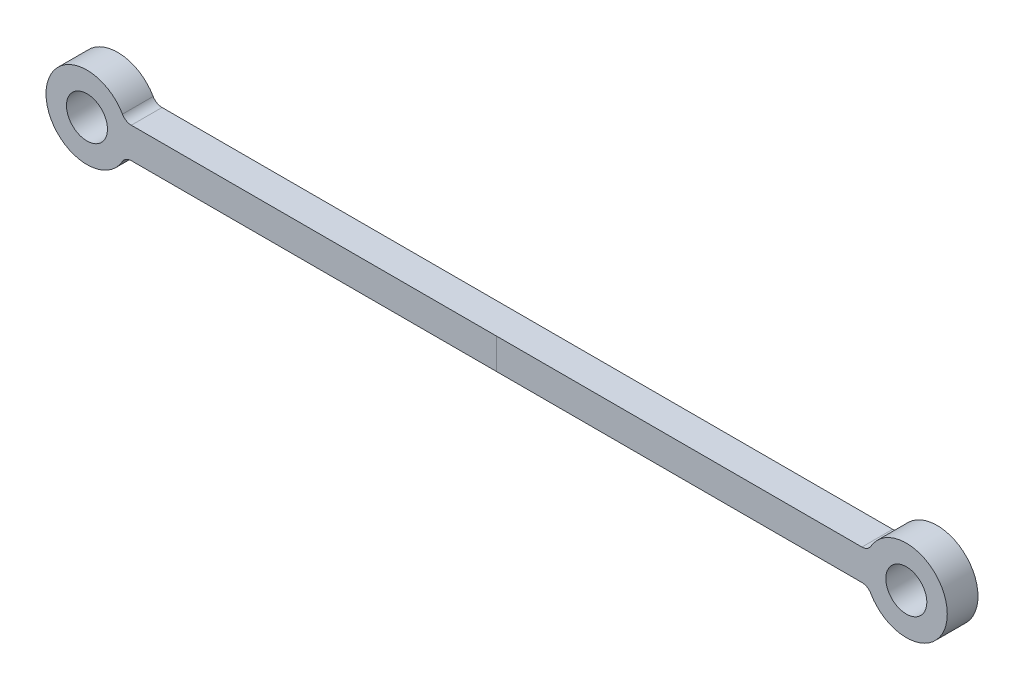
from build123d import *

# Parameters (mm, degrees)
SKETCH1_W            = 800
SKETCH1_H            = 30
EXTRUDE1_DEPTH       = 30
SKETCH2_R            = 40
EXTRUDE2_DEPTH       = 30
SKETCH3_R            = 20
CUT_EXTRUDE1_DEPTH   = 443.83179651
FILLET2_R            = 10
FILLET2_OF_MIRROR1_R = 10


with BuildPart() as part:
    # Sketch1 → Extrude1 (new body)
    with BuildSketch(Plane.XY):
        Rectangle(SKETCH1_W, SKETCH1_H)
    extrude(amount=EXTRUDE1_DEPTH)

    # Sketch2 → Extrude2 (add)
    with BuildSketch(Plane.XY.offset(30)):
        with Locations((-400, 0)):
            Circle(SKETCH2_R)
    extrude2 = extrude(amount=-EXTRUDE2_DEPTH)

    # Sketch3 → Cut-Extrude1 (cut, through all)
    with BuildSketch(Plane.XY.offset(30)):
        with Locations((-400, 0)):
            Circle(SKETCH3_R)
    cut_extrude1 = extrude(amount=-CUT_EXTRUDE1_DEPTH, mode=Mode.SUBTRACT)

    # Fillet2
    fillet2_edges = [part.edges().sort_by_distance(p)[0] for p in [
        (-362.919007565, -15, 15),
        (-362.919007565, 15, 15),
    ]]
    fillet(fillet2_edges, radius=FILLET2_R)

    # Mirror1: Extrude2, Cut-Extrude1 across plane
    add(extrude2.mirror(Plane(origin=(0, 0, 0), x_dir=(0, 0, 1), z_dir=(1, 0, 0))))
    add(cut_extrude1.mirror(Plane(origin=(0, 0, 0), x_dir=(0, 0, 1), z_dir=(1, 0, 0))), mode=Mode.SUBTRACT)

    # Fillet2 of Mirror1
    fillet2_of_mirror1_edges = [part.edges().sort_by_distance(p)[0] for p in [
        (362.919007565, -15, 15),
        (362.919007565, 15, 15),
    ]]
    fillet(fillet2_of_mirror1_edges, radius=FILLET2_OF_MIRROR1_R)


solid = part.part
